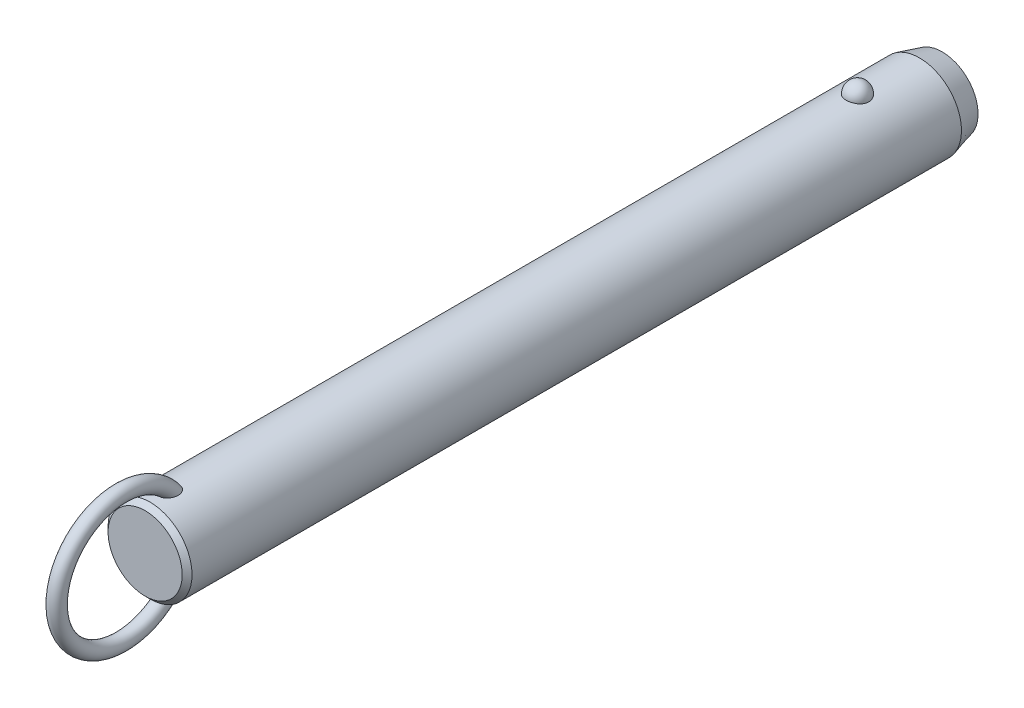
ISO-10303-21;
HEADER;
FILE_DESCRIPTION(('STEP AP214'),'2;1');
FILE_NAME('part.step','',(''),(''),'','','');
FILE_SCHEMA(('AUTOMOTIVE_DESIGN { 1 0 10303 214 1 1 1 1 }'));
ENDSEC;
DATA;
#1=APPLICATION_CONTEXT('core data for automotive mechanical design processes');
#2=APPLICATION_PROTOCOL_DEFINITION('international standard','automotive_design',2000,#1);
#3=PRODUCT_CONTEXT('',#1,'mechanical');
#4=PRODUCT('Part','Part','',(#3));
#5=PRODUCT_RELATED_PRODUCT_CATEGORY('part','',(#4));
#6=PRODUCT_DEFINITION_FORMATION('','',#4);
#7=PRODUCT_DEFINITION_CONTEXT('part definition',#1,'design');
#8=PRODUCT_DEFINITION('design','',#6,#7);
#9=PRODUCT_DEFINITION_SHAPE('','',#8);
#10=(LENGTH_UNIT() NAMED_UNIT(*) SI_UNIT(.MILLI.,.METRE.));
#11=(NAMED_UNIT(*) PLANE_ANGLE_UNIT() SI_UNIT($,.RADIAN.));
#12=(NAMED_UNIT(*) SI_UNIT($,.STERADIAN.) SOLID_ANGLE_UNIT());
#13=UNCERTAINTY_MEASURE_WITH_UNIT(LENGTH_MEASURE(1.E-05),#10,'distance_accuracy_value','');
#14=(GEOMETRIC_REPRESENTATION_CONTEXT(3) GLOBAL_UNCERTAINTY_ASSIGNED_CONTEXT((#13)) GLOBAL_UNIT_ASSIGNED_CONTEXT((#10,
#11,#12)) REPRESENTATION_CONTEXT('',''));
#15=CARTESIAN_POINT('',(0.,0.,0.));
#16=DIRECTION('',(0.,0.,1.));
#17=DIRECTION('',(1.,0.,0.));
#18=AXIS2_PLACEMENT_3D('',#15,#16,#17);
#19=CARTESIAN_POINT('',(0.,0.,172.7));
#20=DIRECTION('',(0.,0.,-1.));
#21=DIRECTION('',(-1.,0.,0.));
#22=AXIS2_PLACEMENT_3D('',#19,#20,#21);
#23=CYLINDRICAL_SURFACE('',#22,11.1);
#24=CARTESIAN_POINT('',(2.9724815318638,10.6945945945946,-3.00000000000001));
#25=CARTESIAN_POINT('',(2.97247830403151,10.6945972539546,-2.8322505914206));
#26=CARTESIAN_POINT('',(2.95876598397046,10.6984356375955,-2.66445972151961));
#27=CARTESIAN_POINT('',(2.90424529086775,10.7133624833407,-2.3336238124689));
#28=CARTESIAN_POINT('',(2.8634252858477,10.7244540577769,-2.17058084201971));
#29=CARTESIAN_POINT('',(2.75573657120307,10.7526272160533,-1.85396767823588));
#30=CARTESIAN_POINT('',(2.68887937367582,10.7697061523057,-1.70039333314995));
#31=CARTESIAN_POINT('',(2.53079696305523,10.8079438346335,-1.4069159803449));
#32=CARTESIAN_POINT('',(2.43957264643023,10.8291024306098,-1.26701246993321));
#33=CARTESIAN_POINT('',(2.23458150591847,10.8732541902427,-1.00409565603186));
#34=CARTESIAN_POINT('',(2.12071295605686,10.8962553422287,-0.881162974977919));
#35=CARTESIAN_POINT('',(1.87365402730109,10.9414421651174,-0.656352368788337));
#36=CARTESIAN_POINT('',(1.74046358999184,10.9636278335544,-0.554474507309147));
#37=CARTESIAN_POINT('',(1.45872188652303,11.0046495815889,-0.374872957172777));
#38=CARTESIAN_POINT('',(1.31021276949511,11.0234944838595,-0.297085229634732));
#39=CARTESIAN_POINT('',(1.00170030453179,11.0557957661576,-0.167529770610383));
#40=CARTESIAN_POINT('',(0.841698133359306,11.0692526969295,-0.1157593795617));
#41=CARTESIAN_POINT('',(0.517607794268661,11.0890932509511,-0.0403925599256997));
#42=CARTESIAN_POINT('',(0.353633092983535,11.0955916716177,-0.0163383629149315));
#43=CARTESIAN_POINT('',(0.0238420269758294,11.1011989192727,0.00445177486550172));
#44=CARTESIAN_POINT('',(-0.141974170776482,11.1003084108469,0.00119017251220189));
#45=CARTESIAN_POINT('',(-0.468405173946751,11.0912990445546,-0.0323233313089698));
#46=CARTESIAN_POINT('',(-0.629059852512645,11.0832767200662,-0.062214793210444));
#47=CARTESIAN_POINT('',(-0.942937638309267,11.0609962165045,-0.147645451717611));
#48=CARTESIAN_POINT('',(-1.09616062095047,11.0467379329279,-0.203185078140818));
#49=CARTESIAN_POINT('',(-1.39181061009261,11.0134071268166,-0.338752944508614));
#50=CARTESIAN_POINT('',(-1.53417383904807,10.9943086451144,-0.418913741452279));
#51=CARTESIAN_POINT('',(-1.80342160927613,10.9533667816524,-0.601448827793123));
#52=CARTESIAN_POINT('',(-1.9303046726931,10.9315231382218,-0.703825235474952));
#53=CARTESIAN_POINT('',(-2.16747598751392,10.887005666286,-0.930091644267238));
#54=CARTESIAN_POINT('',(-2.27742774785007,10.8643239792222,-1.05433291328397));
#55=CARTESIAN_POINT('',(-2.47517316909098,10.8209886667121,-1.31966633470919));
#56=CARTESIAN_POINT('',(-2.56296538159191,10.8003351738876,-1.46075958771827));
#57=CARTESIAN_POINT('',(-2.71500300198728,10.7631304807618,-1.75753646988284));
#58=CARTESIAN_POINT('',(-2.77898901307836,10.7466250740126,-1.91335887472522));
#59=CARTESIAN_POINT('',(-2.88046189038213,10.7198747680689,-2.23391529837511));
#60=CARTESIAN_POINT('',(-2.91794947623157,10.709629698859,-2.3986490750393));
#61=CARTESIAN_POINT('',(-2.96537819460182,10.6965949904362,-2.73165170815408));
#62=CARTESIAN_POINT('',(-2.97542891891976,10.693775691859,-2.89990378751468));
#63=CARTESIAN_POINT('',(-2.96804271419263,10.6958279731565,-3.23575286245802));
#64=CARTESIAN_POINT('',(-2.95060646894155,10.7006993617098,-3.4033498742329));
#65=CARTESIAN_POINT('',(-2.88883358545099,10.71753912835,-3.73233906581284));
#66=CARTESIAN_POINT('',(-2.84462026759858,10.7294749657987,-3.89375610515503));
#67=CARTESIAN_POINT('',(-2.73050447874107,10.7590797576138,-4.20667949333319));
#68=CARTESIAN_POINT('',(-2.66060103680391,10.7767489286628,-4.35818546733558));
#69=CARTESIAN_POINT('',(-2.49642559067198,10.8159599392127,-4.64785421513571));
#70=CARTESIAN_POINT('',(-2.40203047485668,10.8375211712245,-4.78594458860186));
#71=CARTESIAN_POINT('',(-2.19143488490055,10.8820570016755,-5.04410382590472));
#72=CARTESIAN_POINT('',(-2.07523364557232,10.9050316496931,-5.16417205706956));
#73=CARTESIAN_POINT('',(-1.82361254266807,10.9499219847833,-5.3833483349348));
#74=CARTESIAN_POINT('',(-1.68812945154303,10.9718338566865,-5.48238464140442));
#75=CARTESIAN_POINT('',(-1.40191298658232,11.0120611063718,-5.65618873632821));
#76=CARTESIAN_POINT('',(-1.25118062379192,11.0303767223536,-5.73095813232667));
#77=CARTESIAN_POINT('',(-0.940570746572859,11.0611653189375,-5.85334725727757));
#78=CARTESIAN_POINT('',(-0.780821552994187,11.0737044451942,-5.90127578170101));
#79=CARTESIAN_POINT('',(-0.455204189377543,11.0918598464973,-5.96992976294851));
#80=CARTESIAN_POINT('',(-0.289336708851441,11.0974768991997,-5.99065827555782));
#81=CARTESIAN_POINT('',(0.0406846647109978,11.1011307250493,-6.00418773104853));
#82=CARTESIAN_POINT('',(0.204817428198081,11.099299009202,-5.9974731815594));
#83=CARTESIAN_POINT('',(0.5295530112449,11.088551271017,-5.95740317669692));
#84=CARTESIAN_POINT('',(0.69015594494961,11.0796354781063,-5.92404858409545));
#85=CARTESIAN_POINT('',(1.0027760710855,11.0557204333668,-5.83180084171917));
#86=CARTESIAN_POINT('',(1.15482001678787,11.0407414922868,-5.7729929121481));
#87=CARTESIAN_POINT('',(1.44678373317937,11.0062913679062,-5.63147366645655));
#88=CARTESIAN_POINT('',(1.58670279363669,10.9868199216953,-5.54876095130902));
#89=CARTESIAN_POINT('',(1.8527023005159,10.9451315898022,-5.36027644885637));
#90=CARTESIAN_POINT('',(1.97855158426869,10.9228788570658,-5.25418644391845));
#91=CARTESIAN_POINT('',(2.21080872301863,10.8782509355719,-5.02251354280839));
#92=CARTESIAN_POINT('',(2.31721312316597,10.8558757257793,-4.89692718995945));
#93=CARTESIAN_POINT('',(2.5094551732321,10.8130715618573,-4.62745408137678));
#94=CARTESIAN_POINT('',(2.59493284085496,10.7926798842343,-4.48330448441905));
#95=CARTESIAN_POINT('',(2.740862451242,10.7565495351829,-4.18236358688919));
#96=CARTESIAN_POINT('',(2.80132490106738,10.7408089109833,-4.02557762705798));
#97=CARTESIAN_POINT('',(2.88959070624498,10.7173718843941,-3.72475308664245));
#98=CARTESIAN_POINT('',(2.92062102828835,10.7088950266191,-3.58171216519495));
#99=CARTESIAN_POINT('',(2.96206765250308,10.6975052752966,-3.29245795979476));
#100=CARTESIAN_POINT('',(2.97248434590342,10.6945922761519,-3.14624473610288));
#101=CARTESIAN_POINT('',(2.9724815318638,10.6945945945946,-3.00000000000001));
#102=B_SPLINE_CURVE_WITH_KNOTS('',3,(#24,#25,#26,#27,#28,#29,#30,#31,#32,#33,#34,#35,#36,#37,
#38,#39,#40,#41,#42,#43,#44,#45,#46,#47,#48,#49,#50,#51,#52,#53,#54,#55,#56,#57,#58,#59,#60,#61,
#62,#63,#64,#65,#66,#67,#68,#69,#70,#71,#72,#73,#74,#75,#76,#77,#78,#79,#80,#81,#82,#83,#84,#85,
#86,#87,#88,#89,#90,#91,#92,#93,#94,#95,#96,#97,#98,#99,#100,#101),.UNSPECIFIED.,.T.,.F.,(4,2,2,
2,2,2,2,2,2,2,2,2,2,2,2,2,2,2,2,2,2,2,2,2,2,2,2,2,2,2,2,2,2,2,2,2,2,2,4),(0.,0.502722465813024,
1.00566079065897,1.5083769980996,2.01107471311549,2.51608392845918,3.02109467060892,
3.52475118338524,4.02835620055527,4.523518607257,5.0186364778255,5.50715297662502,
5.9956776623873,6.48688002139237,6.97812923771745,7.47814366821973,7.9781907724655,
8.48353712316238,8.9888697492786,9.49218093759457,9.99547960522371,10.4964777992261,
10.997494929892,11.5010810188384,12.0046847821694,12.5099796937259,13.0152411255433,
13.5145635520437,14.0138298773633,14.5043200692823,14.9947943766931,15.4836390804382,
15.9725123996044,16.4685040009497,16.9645836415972,17.4686765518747,17.972557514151,
18.410841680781,18.849117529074),.UNSPECIFIED.);
#103=CARTESIAN_POINT('',(2.9724815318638,10.6945945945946,-3.00000000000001));
#104=VERTEX_POINT('',#103);
#105=EDGE_CURVE('E41',#104,#104,#102,.T.);
#106=ORIENTED_EDGE('',*,*,#105,.T.);
#107=EDGE_LOOP('',(#106));
#108=FACE_BOUND('',#107,.T.);
#109=CARTESIAN_POINT('',(0.,0.,184.1));
#110=DIRECTION('',(0.,0.,1.));
#111=DIRECTION('',(1.,0.,0.));
#112=AXIS2_PLACEMENT_3D('',#109,#110,#111);
#113=CIRCLE('',#112,11.1);
#114=CARTESIAN_POINT('',(11.1,0.,184.1));
#115=VERTEX_POINT('',#114);
#116=EDGE_CURVE('E10',#115,#115,#113,.F.);
#117=ORIENTED_EDGE('',*,*,#116,.T.);
#118=EDGE_LOOP('',(#117));
#119=FACE_BOUND('',#118,.T.);
#120=CARTESIAN_POINT('',(-0.564520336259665,-11.0856356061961,176.357815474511));
#121=CARTESIAN_POINT('',(-0.667202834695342,-11.0804062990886,176.391283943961));
#122=CARTESIAN_POINT('',(-0.766875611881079,-11.0738877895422,176.433835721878));
#123=CARTESIAN_POINT('',(-0.957284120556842,-11.0590576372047,176.535419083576));
#124=CARTESIAN_POINT('',(-1.04801616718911,-11.0507452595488,176.59445742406));
#125=CARTESIAN_POINT('',(-1.21800952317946,-11.0333016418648,176.726529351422));
#126=CARTESIAN_POINT('',(-1.29730805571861,-11.0241732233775,176.799515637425));
#127=CARTESIAN_POINT('',(-1.44337665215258,-11.0060026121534,176.957037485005));
#128=CARTESIAN_POINT('',(-1.51014622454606,-10.9969604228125,177.041573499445));
#129=CARTESIAN_POINT('',(-1.63454620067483,-10.9791841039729,177.225521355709));
#130=CARTESIAN_POINT('',(-1.69127003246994,-10.9705107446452,177.325549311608));
#131=CARTESIAN_POINT('',(-1.7898078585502,-10.9548648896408,177.532790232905));
#132=CARTESIAN_POINT('',(-1.83161214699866,-10.9478935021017,177.640007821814));
#133=CARTESIAN_POINT('',(-1.91557028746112,-10.9335803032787,177.905408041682));
#134=CARTESIAN_POINT('',(-1.95040620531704,-10.9273269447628,178.065980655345));
#135=CARTESIAN_POINT('',(-1.99388326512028,-10.9194709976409,178.390697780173));
#136=CARTESIAN_POINT('',(-2.00248051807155,-10.9178762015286,178.554847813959));
#137=CARTESIAN_POINT('',(-1.99551615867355,-10.9191578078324,178.924650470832));
#138=CARTESIAN_POINT('',(-1.97322066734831,-10.9232807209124,179.130191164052));
#139=CARTESIAN_POINT('',(-1.91529761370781,-10.9335244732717,179.433595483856));
#140=CARTESIAN_POINT('',(-1.89184575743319,-10.9376266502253,179.534088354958));
#141=CARTESIAN_POINT('',(-1.83700674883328,-10.9469720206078,179.732855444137));
#142=CARTESIAN_POINT('',(-1.80562070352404,-10.9522150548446,179.831129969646));
#143=CARTESIAN_POINT('',(-1.73463055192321,-10.9636837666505,180.025914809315));
#144=CARTESIAN_POINT('',(-1.69493416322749,-10.9699202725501,180.122390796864));
#145=CARTESIAN_POINT('',(-1.60745141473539,-10.9830806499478,180.311626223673));
#146=CARTESIAN_POINT('',(-1.55966150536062,-10.9900048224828,180.404384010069));
#147=CARTESIAN_POINT('',(-1.45591812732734,-11.0042280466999,180.584690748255));
#148=CARTESIAN_POINT('',(-1.40000013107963,-11.0115253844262,180.672260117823));
#149=CARTESIAN_POINT('',(-1.27937470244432,-11.0261911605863,180.841029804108));
#150=CARTESIAN_POINT('',(-1.21467835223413,-11.0335594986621,180.92223795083));
#151=CARTESIAN_POINT('',(-1.08218150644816,-11.0473027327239,181.069001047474));
#152=CARTESIAN_POINT('',(-1.01522633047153,-11.0537063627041,181.135309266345));
#153=CARTESIAN_POINT('',(-0.872952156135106,-11.065850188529,181.258378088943));
#154=CARTESIAN_POINT('',(-0.797642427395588,-11.0715911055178,181.315149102));
#155=CARTESIAN_POINT('',(-0.651396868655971,-11.081071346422,181.407515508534));
#156=CARTESIAN_POINT('',(-0.581712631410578,-11.0849841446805,181.445049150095));
#157=CARTESIAN_POINT('',(-0.437066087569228,-11.0916271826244,181.508259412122));
#158=CARTESIAN_POINT('',(-0.362109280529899,-11.0943586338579,181.533948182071));
#159=CARTESIAN_POINT('',(-0.207828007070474,-11.0983242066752,181.571117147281));
#160=CARTESIAN_POINT('',(-0.12846771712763,-11.0995432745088,181.582454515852));
#161=CARTESIAN_POINT('',(0.0309101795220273,-11.1002423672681,181.588965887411));
#162=CARTESIAN_POINT('',(0.110927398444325,-11.0997233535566,181.584148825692));
#163=CARTESIAN_POINT('',(0.25640659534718,-11.097240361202,181.560959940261));
#164=CARTESIAN_POINT('',(0.322235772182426,-11.0955074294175,181.544754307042));
#165=CARTESIAN_POINT('',(0.450635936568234,-11.0910350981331,181.502600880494));
#166=CARTESIAN_POINT('',(0.513205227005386,-11.0882951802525,181.476648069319));
#167=CARTESIAN_POINT('',(0.662626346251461,-11.0805620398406,181.402607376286));
#168=CARTESIAN_POINT('',(0.747127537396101,-11.0751144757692,181.349845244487));
#169=CARTESIAN_POINT('',(0.906756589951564,-11.0631932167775,181.231720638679));
#170=CARTESIAN_POINT('',(0.981859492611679,-11.0567168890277,181.166325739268));
#171=CARTESIAN_POINT('',(1.10712207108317,-11.0447856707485,181.04226337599));
#172=CARTESIAN_POINT('',(1.15909566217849,-11.0394280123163,180.985383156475));
#173=CARTESIAN_POINT('',(1.25791923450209,-11.0286040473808,180.867327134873));
#174=CARTESIAN_POINT('',(1.30476642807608,-11.0231376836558,180.806149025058));
#175=CARTESIAN_POINT('',(1.43818612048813,-11.0068027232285,180.617305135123));
#176=CARTESIAN_POINT('',(1.51751767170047,-10.9960104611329,180.484453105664));
#177=CARTESIAN_POINT('',(1.63597546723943,-10.9788847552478,180.253137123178));
#178=CARTESIAN_POINT('',(1.67988876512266,-10.9722190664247,180.157053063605));
#179=CARTESIAN_POINT('',(1.75953241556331,-10.9597298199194,179.961431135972));
#180=CARTESIAN_POINT('',(1.79525967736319,-10.9539065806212,179.861891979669));
#181=CARTESIAN_POINT('',(1.85844731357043,-10.9433632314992,179.66021118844));
#182=CARTESIAN_POINT('',(1.88591073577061,-10.9386427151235,179.55807052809));
#183=CARTESIAN_POINT('',(1.93234324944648,-10.9305350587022,179.351819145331));
#184=CARTESIAN_POINT('',(1.95131065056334,-10.9271481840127,179.247708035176));
#185=CARTESIAN_POINT('',(1.99040203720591,-10.9201183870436,178.965458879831));
#186=CARTESIAN_POINT('',(2.00221217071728,-10.9179256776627,178.786037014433));
#187=CARTESIAN_POINT('',(1.99711676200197,-10.9188636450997,178.427713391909));
#188=CARTESIAN_POINT('',(1.98026150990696,-10.9219849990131,178.248811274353));
#189=CARTESIAN_POINT('',(1.92151657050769,-10.9324473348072,177.93645144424));
#190=CARTESIAN_POINT('',(1.88605081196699,-10.9386915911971,177.801759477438));
#191=CARTESIAN_POINT('',(1.79393020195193,-10.9541780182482,177.539966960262));
#192=CARTESIAN_POINT('',(1.73729868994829,-10.9634168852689,177.412858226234));
#193=CARTESIAN_POINT('',(1.61237037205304,-10.9824218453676,177.189418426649));
#194=CARTESIAN_POINT('',(1.54715374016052,-10.9918945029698,177.091345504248));
#195=CARTESIAN_POINT('',(1.40127026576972,-11.0114415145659,176.907434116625));
#196=CARTESIAN_POINT('',(1.32060742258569,-11.0215157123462,176.821592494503));
#197=CARTESIAN_POINT('',(1.1447478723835,-11.041168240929,176.665163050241));
#198=CARTESIAN_POINT('',(1.04947805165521,-11.0507437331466,176.594656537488));
#199=CARTESIAN_POINT('',(0.847278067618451,-11.0680789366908,176.472640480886));
#200=CARTESIAN_POINT('',(0.740351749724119,-11.0758392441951,176.421124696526));
#201=CARTESIAN_POINT('',(0.529289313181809,-11.0878275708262,176.343485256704));
#202=CARTESIAN_POINT('',(0.425895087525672,-11.0923259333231,176.315377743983));
#203=CARTESIAN_POINT('',(0.215723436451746,-11.0984001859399,176.277703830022));
#204=CARTESIAN_POINT('',(0.10894793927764,-11.0999777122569,176.268127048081));
#205=CARTESIAN_POINT('',(-0.0938962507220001,-11.1000196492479,176.267877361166));
#206=CARTESIAN_POINT('',(-0.189967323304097,-11.0987797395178,176.275408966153));
#207=CARTESIAN_POINT('',(-0.379657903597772,-11.0939111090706,176.305507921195));
#208=CARTESIAN_POINT('',(-0.473277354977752,-11.0902823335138,176.328075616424));
#209=CARTESIAN_POINT('',(-0.564520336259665,-11.0856356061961,176.357815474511));
#210=B_SPLINE_CURVE_WITH_KNOTS('',3,(#120,#121,#122,#123,#124,#125,#126,#127,#128,#129,#130,
#131,#132,#133,#134,#135,#136,#137,#138,#139,#140,#141,#142,#143,#144,#145,#146,#147,#148,#149,
#150,#151,#152,#153,#154,#155,#156,#157,#158,#159,#160,#161,#162,#163,#164,#165,#166,#167,#168,
#169,#170,#171,#172,#173,#174,#175,#176,#177,#178,#179,#180,#181,#182,#183,#184,#185,#186,#187,
#188,#189,#190,#191,#192,#193,#194,#195,#196,#197,#198,#199,#200,#201,#202,#203,#204,#205,#206,
#207,#208,#209),.UNSPECIFIED.,.T.,.F.,(4,2,2,2,2,2,2,2,2,2,2,2,2,2,2,2,2,2,2,2,2,2,2,2,2,2,2,2,
2,2,2,2,2,2,2,2,2,2,2,2,2,2,2,2,4),(0.,0.323999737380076,0.648132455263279,0.971184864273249,
1.29424994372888,1.63886237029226,1.98369857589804,2.47426059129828,2.96564271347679,
3.58257396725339,3.89215258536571,4.20168803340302,4.51486273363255,4.82817514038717,
5.14015911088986,5.45175282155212,5.73442856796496,6.01679375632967,6.25364580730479,
6.49025437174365,6.72919963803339,6.96801276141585,7.17061258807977,7.37331685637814,
7.67094989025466,7.96935728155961,8.20075067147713,8.43226927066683,8.89581623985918,
9.21306533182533,9.5304340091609,9.84768549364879,10.1650000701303,10.7022930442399,
11.2386443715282,11.655339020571,12.071575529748,12.4245637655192,12.7774607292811,
13.1321855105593,13.4867936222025,13.8068771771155,14.1267813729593,14.4146787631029,
14.7025827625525),.UNSPECIFIED.);
#211=CARTESIAN_POINT('',(-0.564520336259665,-11.0856356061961,176.357815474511));
#212=VERTEX_POINT('',#211);
#213=EDGE_CURVE('E59',#212,#212,#210,.T.);
#214=ORIENTED_EDGE('',*,*,#213,.T.);
#215=EDGE_LOOP('',(#214));
#216=FACE_BOUND('',#215,.T.);
#217=CARTESIAN_POINT('',(-0.564520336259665,11.0856356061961,176.357815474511));
#218=CARTESIAN_POINT('',(-0.468542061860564,11.0905203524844,176.326545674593));
#219=CARTESIAN_POINT('',(-0.369793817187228,11.0942886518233,176.303157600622));
#220=CARTESIAN_POINT('',(-0.169555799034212,11.0991586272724,176.273085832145));
#221=CARTESIAN_POINT('',(-0.0680604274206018,11.1002543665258,176.26643932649));
#222=CARTESIAN_POINT('',(0.13454973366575,11.099646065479,176.270157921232));
#223=CARTESIAN_POINT('',(0.235664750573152,11.0979441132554,176.28051033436));
#224=CARTESIAN_POINT('',(0.434632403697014,11.0919342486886,176.317831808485));
#225=CARTESIAN_POINT('',(0.532486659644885,11.0876276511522,176.344792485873));
#226=CARTESIAN_POINT('',(0.722445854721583,11.0768742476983,176.4144096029));
#227=CARTESIAN_POINT('',(0.814543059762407,11.0704246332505,176.457086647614));
#228=CARTESIAN_POINT('',(0.990565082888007,11.0560659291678,176.556648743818));
#229=CARTESIAN_POINT('',(1.07448844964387,11.048156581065,176.613536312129));
#230=CARTESIAN_POINT('',(1.23562672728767,11.0313221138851,176.742210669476));
#231=CARTESIAN_POINT('',(1.3124268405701,11.0223686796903,176.814511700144));
#232=CARTESIAN_POINT('',(1.45398030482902,11.0045918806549,176.970042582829));
#233=CARTESIAN_POINT('',(1.51873073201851,10.9957685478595,177.053275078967));
#234=CARTESIAN_POINT('',(1.64107232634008,10.9782087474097,177.236384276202));
#235=CARTESIAN_POINT('',(1.6974317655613,10.9695572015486,177.337089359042));
#236=CARTESIAN_POINT('',(1.79515063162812,10.9539887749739,177.545626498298));
#237=CARTESIAN_POINT('',(1.83649966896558,10.9470730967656,177.65346343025));
#238=CARTESIAN_POINT('',(1.91931148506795,10.9329211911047,177.920399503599));
#239=CARTESIAN_POINT('',(1.95340104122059,10.9267904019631,178.081861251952));
#240=CARTESIAN_POINT('',(1.99526195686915,10.9192174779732,178.40821631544));
#241=CARTESIAN_POINT('',(2.00298989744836,10.9177830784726,178.57311484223));
#242=CARTESIAN_POINT('',(1.99396251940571,10.9194420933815,178.944100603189));
#243=CARTESIAN_POINT('',(1.97050829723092,10.923774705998,179.15003871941));
#244=CARTESIAN_POINT('',(1.91079643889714,10.9343131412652,179.453901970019));
#245=CARTESIAN_POINT('',(1.88673702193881,10.9385106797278,179.554529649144));
#246=CARTESIAN_POINT('',(1.83065508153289,10.9480376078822,179.753510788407));
#247=CARTESIAN_POINT('',(1.79863369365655,10.9533668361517,179.851864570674));
#248=CARTESIAN_POINT('',(1.72633365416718,10.9649954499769,180.046720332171));
#249=CARTESIAN_POINT('',(1.68596409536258,10.9713053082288,180.14318790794));
#250=CARTESIAN_POINT('',(1.59707998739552,10.9845964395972,180.332323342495));
#251=CARTESIAN_POINT('',(1.54856169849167,10.9915780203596,180.424989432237));
#252=CARTESIAN_POINT('',(1.44330168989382,11.0058935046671,180.604975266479));
#253=CARTESIAN_POINT('',(1.3865974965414,11.0132257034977,180.692316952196));
#254=CARTESIAN_POINT('',(1.2643115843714,11.0279330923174,180.860456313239));
#255=CARTESIAN_POINT('',(1.19874160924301,11.0353082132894,180.941262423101));
#256=CARTESIAN_POINT('',(1.06542088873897,11.048931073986,181.085985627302));
#257=CARTESIAN_POINT('',(0.998640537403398,11.0552153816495,181.150784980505));
#258=CARTESIAN_POINT('',(0.856896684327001,11.0671032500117,181.270846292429));
#259=CARTESIAN_POINT('',(0.781942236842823,11.0727075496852,181.326118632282));
#260=CARTESIAN_POINT('',(0.636276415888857,11.081949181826,181.415972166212));
#261=CARTESIAN_POINT('',(0.566755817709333,11.0857572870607,181.452441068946));
#262=CARTESIAN_POINT('',(0.422602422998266,11.0921860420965,181.513533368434));
#263=CARTESIAN_POINT('',(0.347974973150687,11.0948079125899,181.538168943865));
#264=CARTESIAN_POINT('',(0.194593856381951,11.0985608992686,181.573323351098));
#265=CARTESIAN_POINT('',(0.115807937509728,11.0996777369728,181.583706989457));
#266=CARTESIAN_POINT('',(-0.0422499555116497,11.1002003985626,181.588574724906));
#267=CARTESIAN_POINT('',(-0.121521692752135,11.09960699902,181.583066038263));
#268=CARTESIAN_POINT('',(-0.266046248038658,11.0970123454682,181.558827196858));
#269=CARTESIAN_POINT('',(-0.331661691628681,11.0952283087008,181.542135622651));
#270=CARTESIAN_POINT('',(-0.459588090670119,11.0906663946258,181.499111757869));
#271=CARTESIAN_POINT('',(-0.52189737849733,11.0878880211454,181.472774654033));
#272=CARTESIAN_POINT('',(-0.671446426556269,11.0800342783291,181.397513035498));
#273=CARTESIAN_POINT('',(-0.756250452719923,11.0744969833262,181.343818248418));
#274=CARTESIAN_POINT('',(-0.916349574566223,11.0624045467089,181.223802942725));
#275=CARTESIAN_POINT('',(-0.991618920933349,11.0558467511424,181.157449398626));
#276=CARTESIAN_POINT('',(-1.11713140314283,11.0437783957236,181.031633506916));
#277=CARTESIAN_POINT('',(-1.16920539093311,11.0383619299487,180.973952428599));
#278=CARTESIAN_POINT('',(-1.26817476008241,11.02743010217,180.854280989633));
#279=CARTESIAN_POINT('',(-1.31506731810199,11.0219146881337,180.792288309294));
#280=CARTESIAN_POINT('',(-1.40399813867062,11.0109399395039,180.664784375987));
#281=CARTESIAN_POINT('',(-1.44602864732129,11.0054807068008,180.599267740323));
#282=CARTESIAN_POINT('',(-1.52538779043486,10.9947621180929,180.465422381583));
#283=CARTESIAN_POINT('',(-1.56271516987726,10.9895028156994,180.397092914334));
#284=CARTESIAN_POINT('',(-1.64537943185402,10.9774790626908,180.233210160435));
#285=CARTESIAN_POINT('',(-1.68879497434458,10.9708503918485,180.1366735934));
#286=CARTESIAN_POINT('',(-1.76740738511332,10.9584602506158,179.940236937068));
#287=CARTESIAN_POINT('',(-1.80260120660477,10.95269910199,179.840335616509));
#288=CARTESIAN_POINT('',(-1.86468657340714,10.9423003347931,179.637966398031));
#289=CARTESIAN_POINT('',(-1.8915816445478,10.9376622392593,179.535499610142));
#290=CARTESIAN_POINT('',(-1.93682458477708,10.9297405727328,179.328642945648));
#291=CARTESIAN_POINT('',(-1.95517082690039,10.9264572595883,179.224252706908));
#292=CARTESIAN_POINT('',(-1.99232562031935,10.9197647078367,178.94262876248));
#293=CARTESIAN_POINT('',(-2.00294603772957,10.9177914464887,178.764185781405));
#294=CARTESIAN_POINT('',(-1.99566675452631,10.9191290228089,178.407996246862));
#295=CARTESIAN_POINT('',(-1.97781651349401,10.9224306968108,178.23024902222));
#296=CARTESIAN_POINT('',(-1.91747214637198,10.9331592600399,177.919792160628));
#297=CARTESIAN_POINT('',(-1.88131022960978,10.9395108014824,177.785825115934));
#298=CARTESIAN_POINT('',(-1.78790380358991,10.9551659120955,177.52559757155));
#299=CARTESIAN_POINT('',(-1.73068309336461,10.9644661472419,177.399328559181));
#300=CARTESIAN_POINT('',(-1.60475573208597,10.9835398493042,177.17741565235));
#301=CARTESIAN_POINT('',(-1.53908879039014,10.9930297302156,177.080026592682));
#302=CARTESIAN_POINT('',(-1.39238608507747,11.0125708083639,176.897525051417));
#303=CARTESIAN_POINT('',(-1.31135150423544,11.0226219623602,176.812411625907));
#304=CARTESIAN_POINT('',(-1.14382035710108,11.0411991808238,176.66529943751));
#305=CARTESIAN_POINT('',(-1.0585850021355,11.0497792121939,176.60186930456));
#306=CARTESIAN_POINT('',(-0.878723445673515,11.0655285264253,176.490250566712));
#307=CARTESIAN_POINT('',(-0.784123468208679,11.0727015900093,176.442020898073));
#308=CARTESIAN_POINT('',(-0.646163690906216,11.0812501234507,176.386023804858));
#309=CARTESIAN_POINT('',(-0.605595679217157,11.0835451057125,176.371197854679));
#310=CARTESIAN_POINT('',(-0.564520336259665,11.0856356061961,176.357815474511));
#311=B_SPLINE_CURVE_WITH_KNOTS('',3,(#217,#218,#219,#220,#221,#222,#223,#224,#225,#226,#227,
#228,#229,#230,#231,#232,#233,#234,#235,#236,#237,#238,#239,#240,#241,#242,#243,#244,#245,#246,
#247,#248,#249,#250,#251,#252,#253,#254,#255,#256,#257,#258,#259,#260,#261,#262,#263,#264,#265,
#266,#267,#268,#269,#270,#271,#272,#273,#274,#275,#276,#277,#278,#279,#280,#281,#282,#283,#284,
#285,#286,#287,#288,#289,#290,#291,#292,#293,#294,#295,#296,#297,#298,#299,#300,#301,#302,#303,
#304,#305,#306,#307,#308,#309,#310),.UNSPECIFIED.,.T.,.F.,(4,2,2,2,2,2,2,2,2,2,2,2,2,2,2,2,2,2,
2,2,2,2,2,2,2,2,2,2,2,2,2,2,2,2,2,2,2,2,2,2,2,2,2,2,2,2,4),(0.,0.303061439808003,
0.606795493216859,0.910302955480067,1.21365733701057,1.51741085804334,1.82121821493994,
2.13745205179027,2.45376252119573,2.799586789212,3.14564996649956,3.63832391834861,
4.13180893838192,4.75031912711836,5.06071926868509,5.37107516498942,5.68500772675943,
5.99908475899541,6.31176519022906,6.62403542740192,6.90315673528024,7.18197194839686,
7.41687778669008,7.65154134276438,7.88841587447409,8.12518286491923,8.32752842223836,
8.52997509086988,8.82986421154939,9.13054668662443,9.36393502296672,9.59744991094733,
9.83133221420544,10.0652767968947,10.383032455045,10.7009056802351,11.0186436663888,
11.3364420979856,11.8705925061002,12.4038159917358,12.8189662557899,13.2336487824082,
13.5857049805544,13.9377340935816,14.2561354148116,14.5736690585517,14.7033687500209),.UNSPECIFIED.);
#312=CARTESIAN_POINT('',(-0.564520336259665,11.0856356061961,176.357815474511));
#313=VERTEX_POINT('',#312);
#314=EDGE_CURVE('E67',#313,#313,#311,.T.);
#315=ORIENTED_EDGE('',*,*,#314,.T.);
#316=EDGE_LOOP('',(#315));
#317=FACE_BOUND('',#316,.T.);
#318=CARTESIAN_POINT('',(0.,0.,-19.3999999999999));
#319=DIRECTION('',(0.,0.,-1.));
#320=DIRECTION('',(-1.,0.,0.));
#321=AXIS2_PLACEMENT_3D('',#318,#319,#320);
#322=CIRCLE('',#321,11.1);
#323=CARTESIAN_POINT('',(-11.1,0.,-19.3999999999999));
#324=VERTEX_POINT('',#323);
#325=EDGE_CURVE('E56',#324,#324,#322,.F.);
#326=ORIENTED_EDGE('',*,*,#325,.T.);
#327=EDGE_LOOP('',(#326));
#328=FACE_BOUND('',#327,.T.);
#329=ADVANCED_FACE('F37',(#108,#119,#216,#317,#328),#23,.T.);
#330=CARTESIAN_POINT('',(0.,0.,-25.4));
#331=DIRECTION('',(0.,0.,-1.));
#332=DIRECTION('',(-1.,0.,0.));
#333=AXIS2_PLACEMENT_3D('',#330,#331,#332);
#334=PLANE('',#333);
#335=CARTESIAN_POINT('',(0.,0.,-25.4));
#336=DIRECTION('',(0.,0.,-1.));
#337=DIRECTION('',(-1.,0.,0.));
#338=AXIS2_PLACEMENT_3D('',#335,#336,#337);
#339=CIRCLE('',#338,9.49230484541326);
#340=CARTESIAN_POINT('',(-9.49230484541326,0.,-25.4));
#341=VERTEX_POINT('',#340);
#342=EDGE_CURVE('E66',#341,#341,#339,.T.);
#343=ORIENTED_EDGE('',*,*,#342,.T.);
#344=EDGE_LOOP('',(#343));
#345=FACE_BOUND('',#344,.T.);
#346=ADVANCED_FACE('F85',(#345),#334,.T.);
#347=CARTESIAN_POINT('',(0.,0.,-25.4));
#348=DIRECTION('',(0.,0.,1.));
#349=DIRECTION('',(1.,0.,0.));
#350=AXIS2_PLACEMENT_3D('',#347,#348,#349);
#351=CONICAL_SURFACE('',#350,9.49230484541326,0.261799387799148);
#352=ORIENTED_EDGE('',*,*,#325,.F.);
#353=EDGE_LOOP('',(#352));
#354=FACE_BOUND('',#353,.T.);
#355=ORIENTED_EDGE('',*,*,#342,.F.);
#356=EDGE_LOOP('',(#355));
#357=FACE_BOUND('',#356,.T.);
#358=ADVANCED_FACE('F83',(#354,#357),#351,.T.);
#359=CARTESIAN_POINT('',(0.,0.,185.4));
#360=DIRECTION('',(0.,0.,1.));
#361=DIRECTION('',(1.,0.,0.));
#362=AXIS2_PLACEMENT_3D('',#359,#360,#361);
#363=PLANE('',#362);
#364=CARTESIAN_POINT('',(0.,0.,185.4));
#365=DIRECTION('',(0.,0.,1.));
#366=DIRECTION('',(1.,0.,0.));
#367=AXIS2_PLACEMENT_3D('',#364,#365,#366);
#368=CIRCLE('',#367,9.79999999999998);
#369=CARTESIAN_POINT('',(9.79999999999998,0.,185.4));
#370=VERTEX_POINT('',#369);
#371=EDGE_CURVE('E50',#370,#370,#368,.T.);
#372=ORIENTED_EDGE('',*,*,#371,.T.);
#373=EDGE_LOOP('',(#372));
#374=FACE_BOUND('',#373,.T.);
#375=ADVANCED_FACE('F77',(#374),#363,.T.);
#376=CARTESIAN_POINT('',(0.,0.,191.75));
#377=DIRECTION('',(1.,0.,0.));
#378=DIRECTION('',(0.,0.,-1.));
#379=AXIS2_PLACEMENT_3D('',#376,#377,#378);
#380=TOROIDAL_SURFACE('',#379,17.05,2.);
#381=ORIENTED_EDGE('',*,*,#314,.F.);
#382=EDGE_LOOP('',(#381));
#383=FACE_BOUND('',#382,.T.);
#384=ORIENTED_EDGE('',*,*,#213,.F.);
#385=EDGE_LOOP('',(#384));
#386=FACE_BOUND('',#385,.T.);
#387=ADVANCED_FACE('F73',(#383,#386),#380,.T.);
#388=CARTESIAN_POINT('',(0.,0.,185.4));
#389=DIRECTION('',(0.,0.,-1.));
#390=DIRECTION('',(-1.,0.,0.));
#391=AXIS2_PLACEMENT_3D('',#388,#389,#390);
#392=CONICAL_SURFACE('',#391,9.79999999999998,0.785398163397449);
#393=ORIENTED_EDGE('',*,*,#116,.F.);
#394=EDGE_LOOP('',(#393));
#395=FACE_BOUND('',#394,.T.);
#396=ORIENTED_EDGE('',*,*,#371,.F.);
#397=EDGE_LOOP('',(#396));
#398=FACE_BOUND('',#397,.T.);
#399=ADVANCED_FACE('F39',(#395,#398),#392,.T.);
#400=CARTESIAN_POINT('',(0.,11.1,-3.00000000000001));
#401=DIRECTION('',(0.,1.,0.));
#402=DIRECTION('',(0.,0.,-1.));
#403=AXIS2_PLACEMENT_3D('',#400,#401,#402);
#404=SPHERICAL_SURFACE('',#403,3.);
#405=ORIENTED_EDGE('',*,*,#105,.F.);
#406=EDGE_LOOP('',(#405));
#407=FACE_BOUND('',#406,.T.);
#408=ADVANCED_FACE('F79',(#407),#404,.T.);
#409=CLOSED_SHELL('',(#329,#346,#358,#375,#387,#399,#408));
#410=MANIFOLD_SOLID_BREP('B2',#409);
#411=ADVANCED_BREP_SHAPE_REPRESENTATION('',(#18,#410),#14);
#412=SHAPE_DEFINITION_REPRESENTATION(#9,#411);
ENDSEC;
END-ISO-10303-21;
